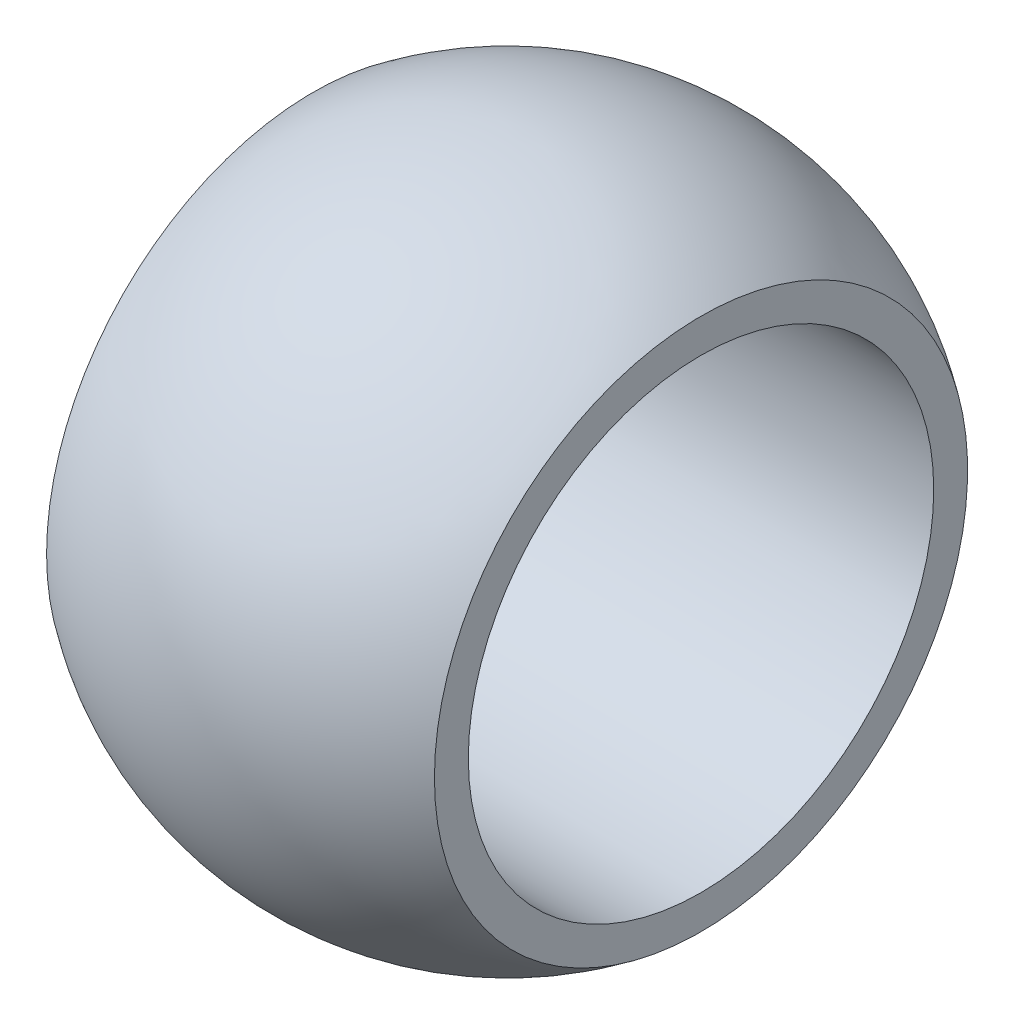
ISO-10303-21;
HEADER;
FILE_DESCRIPTION(('STEP AP214'),'2;1');
FILE_NAME('part.step','',(''),(''),'','','');
FILE_SCHEMA(('AUTOMOTIVE_DESIGN { 1 0 10303 214 1 1 1 1 }'));
ENDSEC;
DATA;
#1=APPLICATION_CONTEXT('core data for automotive mechanical design processes');
#2=APPLICATION_PROTOCOL_DEFINITION('international standard','automotive_design',2000,#1);
#3=PRODUCT_CONTEXT('',#1,'mechanical');
#4=PRODUCT('Part','Part','',(#3));
#5=PRODUCT_RELATED_PRODUCT_CATEGORY('part','',(#4));
#6=PRODUCT_DEFINITION_FORMATION('','',#4);
#7=PRODUCT_DEFINITION_CONTEXT('part definition',#1,'design');
#8=PRODUCT_DEFINITION('design','',#6,#7);
#9=PRODUCT_DEFINITION_SHAPE('','',#8);
#10=(LENGTH_UNIT() NAMED_UNIT(*) SI_UNIT(.MILLI.,.METRE.));
#11=(NAMED_UNIT(*) PLANE_ANGLE_UNIT() SI_UNIT($,.RADIAN.));
#12=(NAMED_UNIT(*) SI_UNIT($,.STERADIAN.) SOLID_ANGLE_UNIT());
#13=UNCERTAINTY_MEASURE_WITH_UNIT(LENGTH_MEASURE(1.E-05),#10,'distance_accuracy_value','');
#14=(GEOMETRIC_REPRESENTATION_CONTEXT(3) GLOBAL_UNCERTAINTY_ASSIGNED_CONTEXT((#13)) GLOBAL_UNIT_ASSIGNED_CONTEXT((#10,
#11,#12)) REPRESENTATION_CONTEXT('',''));
#15=CARTESIAN_POINT('',(0.,0.,0.));
#16=DIRECTION('',(0.,0.,1.));
#17=DIRECTION('',(1.,0.,0.));
#18=AXIS2_PLACEMENT_3D('',#15,#16,#17);
#19=CARTESIAN_POINT('',(0.,0.,0.));
#20=DIRECTION('',(0.,0.,1.));
#21=DIRECTION('',(1.,0.,0.));
#22=AXIS2_PLACEMENT_3D('',#19,#20,#21);
#23=SPHERICAL_SURFACE('',#22,8.5);
#24=CARTESIAN_POINT('',(0.,0.,0.));
#25=DIRECTION('',(-1.,0.,0.));
#26=DIRECTION('',(0.,0.,1.));
#27=AXIS2_PLACEMENT_3D('',#24,#25,#26);
#28=SPHERICAL_SURFACE('',#27,8.5);
#29=CARTESIAN_POINT('',(-5.,0.,0.));
#30=DIRECTION('',(-1.,0.,0.));
#31=DIRECTION('',(0.,0.,1.));
#32=AXIS2_PLACEMENT_3D('',#29,#30,#31);
#33=CIRCLE('',#32,6.87386354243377);
#34=CARTESIAN_POINT('',(-5.,0.,6.87386354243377));
#35=VERTEX_POINT('',#34);
#36=EDGE_CURVE('E10',#35,#35,#33,.T.);
#37=ORIENTED_EDGE('',*,*,#36,.F.);
#38=EDGE_LOOP('',(#37));
#39=FACE_BOUND('',#38,.T.);
#40=CARTESIAN_POINT('',(4.99999999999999,0.,0.));
#41=DIRECTION('',(-1.,0.,0.));
#42=DIRECTION('',(0.,0.,1.));
#43=AXIS2_PLACEMENT_3D('',#40,#41,#42);
#44=CIRCLE('',#43,6.87386354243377);
#45=CARTESIAN_POINT('',(4.99999999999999,0.,6.87386354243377));
#46=VERTEX_POINT('',#45);
#47=EDGE_CURVE('E44',#46,#46,#44,.T.);
#48=ORIENTED_EDGE('',*,*,#47,.T.);
#49=EDGE_LOOP('',(#48));
#50=FACE_BOUND('',#49,.T.);
#51=ADVANCED_FACE('F30',(#39,#50),#28,.T.);
#52=CARTESIAN_POINT('',(-5.00000000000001,6.87386354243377,0.));
#53=DIRECTION('',(1.,0.,0.));
#54=DIRECTION('',(0.,0.,-1.));
#55=AXIS2_PLACEMENT_3D('',#52,#53,#54);
#56=PLANE('',#55);
#57=CARTESIAN_POINT('',(-5.,0.,0.));
#58=DIRECTION('',(-1.,0.,0.));
#59=DIRECTION('',(0.,0.,1.));
#60=AXIS2_PLACEMENT_3D('',#57,#58,#59);
#61=CIRCLE('',#60,6.);
#62=CARTESIAN_POINT('',(-5.,0.,6.));
#63=VERTEX_POINT('',#62);
#64=EDGE_CURVE('E36',#63,#63,#61,.T.);
#65=ORIENTED_EDGE('',*,*,#64,.F.);
#66=EDGE_LOOP('',(#65));
#67=FACE_BOUND('',#66,.T.);
#68=ORIENTED_EDGE('',*,*,#36,.T.);
#69=EDGE_LOOP('',(#68));
#70=FACE_BOUND('',#69,.T.);
#71=ADVANCED_FACE('F59',(#67,#70),#56,.F.);
#72=CARTESIAN_POINT('',(-70.,0.,0.));
#73=DIRECTION('',(-1.,0.,0.));
#74=DIRECTION('',(0.,0.,1.));
#75=AXIS2_PLACEMENT_3D('',#72,#73,#74);
#76=CYLINDRICAL_SURFACE('',#75,6.);
#77=CARTESIAN_POINT('',(4.99999999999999,0.,0.));
#78=DIRECTION('',(-1.,0.,0.));
#79=DIRECTION('',(0.,0.,1.));
#80=AXIS2_PLACEMENT_3D('',#77,#78,#79);
#81=CIRCLE('',#80,6.);
#82=CARTESIAN_POINT('',(4.99999999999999,0.,6.));
#83=VERTEX_POINT('',#82);
#84=EDGE_CURVE('E40',#83,#83,#81,.T.);
#85=ORIENTED_EDGE('',*,*,#84,.F.);
#86=EDGE_LOOP('',(#85));
#87=FACE_BOUND('',#86,.T.);
#88=ORIENTED_EDGE('',*,*,#64,.T.);
#89=EDGE_LOOP('',(#88));
#90=FACE_BOUND('',#89,.T.);
#91=ADVANCED_FACE('F53',(#87,#90),#76,.F.);
#92=CARTESIAN_POINT('',(4.99999999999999,6.87386354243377,0.));
#93=DIRECTION('',(1.,0.,0.));
#94=DIRECTION('',(0.,0.,-1.));
#95=AXIS2_PLACEMENT_3D('',#92,#93,#94);
#96=PLANE('',#95);
#97=ORIENTED_EDGE('',*,*,#84,.T.);
#98=EDGE_LOOP('',(#97));
#99=FACE_BOUND('',#98,.T.);
#100=ORIENTED_EDGE('',*,*,#47,.F.);
#101=EDGE_LOOP('',(#100));
#102=FACE_BOUND('',#101,.T.);
#103=ADVANCED_FACE('F51',(#99,#102),#96,.T.);
#104=CLOSED_SHELL('',(#51,#71,#91,#103));
#105=MANIFOLD_SOLID_BREP('B2',#104);
#106=ADVANCED_BREP_SHAPE_REPRESENTATION('',(#18,#105),#14);
#107=SHAPE_DEFINITION_REPRESENTATION(#9,#106);
ENDSEC;
END-ISO-10303-21;
